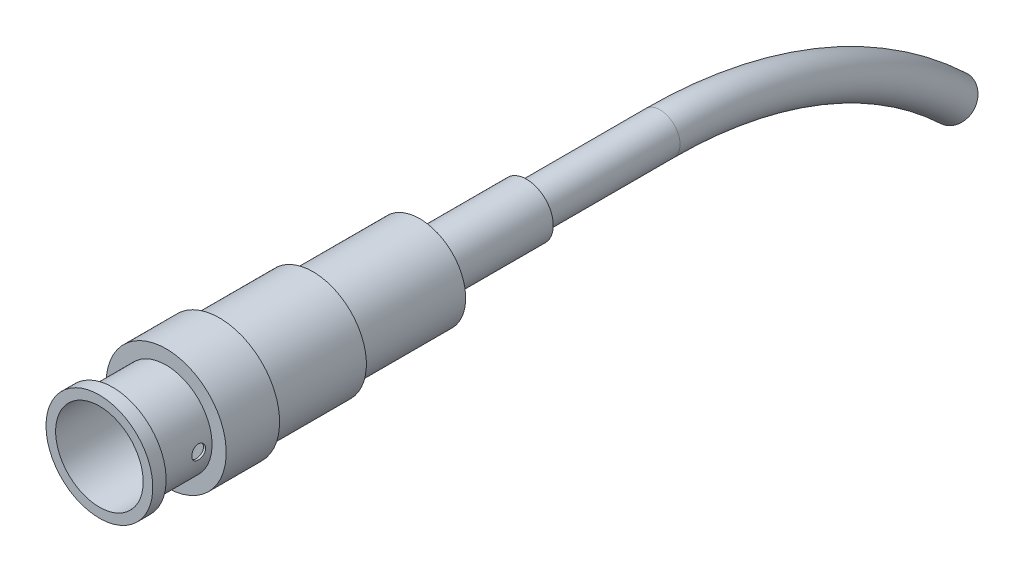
ISO-10303-21;
HEADER;
FILE_DESCRIPTION(('STEP AP214'),'2;1');
FILE_NAME('part.step','',(''),(''),'','','');
FILE_SCHEMA(('AUTOMOTIVE_DESIGN { 1 0 10303 214 1 1 1 1 }'));
ENDSEC;
DATA;
#1=APPLICATION_CONTEXT('core data for automotive mechanical design processes');
#2=APPLICATION_PROTOCOL_DEFINITION('international standard','automotive_design',2000,#1);
#3=PRODUCT_CONTEXT('',#1,'mechanical');
#4=PRODUCT('Part','Part','',(#3));
#5=PRODUCT_RELATED_PRODUCT_CATEGORY('part','',(#4));
#6=PRODUCT_DEFINITION_FORMATION('','',#4);
#7=PRODUCT_DEFINITION_CONTEXT('part definition',#1,'design');
#8=PRODUCT_DEFINITION('design','',#6,#7);
#9=PRODUCT_DEFINITION_SHAPE('','',#8);
#10=(LENGTH_UNIT() NAMED_UNIT(*) SI_UNIT(.MILLI.,.METRE.));
#11=(NAMED_UNIT(*) PLANE_ANGLE_UNIT() SI_UNIT($,.RADIAN.));
#12=(NAMED_UNIT(*) SI_UNIT($,.STERADIAN.) SOLID_ANGLE_UNIT());
#13=UNCERTAINTY_MEASURE_WITH_UNIT(LENGTH_MEASURE(1.E-05),#10,'distance_accuracy_value','');
#14=(GEOMETRIC_REPRESENTATION_CONTEXT(3) GLOBAL_UNCERTAINTY_ASSIGNED_CONTEXT((#13)) GLOBAL_UNIT_ASSIGNED_CONTEXT((#10,
#11,#12)) REPRESENTATION_CONTEXT('',''));
#15=CARTESIAN_POINT('',(0.,0.,0.));
#16=DIRECTION('',(0.,0.,1.));
#17=DIRECTION('',(1.,0.,0.));
#18=AXIS2_PLACEMENT_3D('',#15,#16,#17);
#19=CARTESIAN_POINT('',(0.,0.,0.));
#20=DIRECTION('',(0.,0.,-1.));
#21=DIRECTION('',(-1.,0.,0.));
#22=AXIS2_PLACEMENT_3D('',#19,#20,#21);
#23=CYLINDRICAL_SURFACE('',#22,5.461);
#24=CARTESIAN_POINT('',(5.461,0.,-5.5245));
#25=CARTESIAN_POINT('',(5.46099925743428,0.0460869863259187,-5.52450189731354));
#26=CARTESIAN_POINT('',(5.46041047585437,0.092200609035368,-5.52837252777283));
#27=CARTESIAN_POINT('',(5.45811837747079,0.1831386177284,-5.543748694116));
#28=CARTESIAN_POINT('',(5.45641397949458,0.227961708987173,-5.55526163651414));
#29=CARTESIAN_POINT('',(5.45208215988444,0.31498946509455,-5.58557030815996));
#30=CARTESIAN_POINT('',(5.44945543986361,0.357196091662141,-5.60436050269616));
#31=CARTESIAN_POINT('',(5.44356913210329,0.437850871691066,-5.64867670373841));
#32=CARTESIAN_POINT('',(5.44030963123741,0.476299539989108,-5.67420178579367));
#33=CARTESIAN_POINT('',(5.43349125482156,0.548658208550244,-5.73147881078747));
#34=CARTESIAN_POINT('',(5.42993042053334,0.582534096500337,-5.76327361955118));
#35=CARTESIAN_POINT('',(5.4229260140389,0.644491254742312,-5.83209531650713));
#36=CARTESIAN_POINT('',(5.41948244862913,0.672572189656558,-5.86912250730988));
#37=CARTESIAN_POINT('',(5.41308346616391,0.722275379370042,-5.94758744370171));
#38=CARTESIAN_POINT('',(5.41013058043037,0.743864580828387,-5.98904635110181));
#39=CARTESIAN_POINT('',(5.4050740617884,0.779760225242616,-6.07505393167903));
#40=CARTESIAN_POINT('',(5.40297038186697,0.794067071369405,-6.11960243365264));
#41=CARTESIAN_POINT('',(5.39986973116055,0.814885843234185,-6.21016568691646));
#42=CARTESIAN_POINT('',(5.39886446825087,0.821456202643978,-6.25616671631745));
#43=CARTESIAN_POINT('',(5.39804930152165,0.826796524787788,-6.34862852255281));
#44=CARTESIAN_POINT('',(5.39823932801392,0.825566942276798,-6.3950892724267));
#45=CARTESIAN_POINT('',(5.39978568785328,0.81539002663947,-6.48673859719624));
#46=CARTESIAN_POINT('',(5.40113218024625,0.80650781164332,-6.53193459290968));
#47=CARTESIAN_POINT('',(5.4048243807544,0.781379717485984,-6.62018728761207));
#48=CARTESIAN_POINT('',(5.40717011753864,0.765133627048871,-6.66324392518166));
#49=CARTESIAN_POINT('',(5.41260735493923,0.72567133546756,-6.74619359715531));
#50=CARTESIAN_POINT('',(5.4157017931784,0.702427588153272,-6.78607332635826));
#51=CARTESIAN_POINT('',(5.42228564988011,0.64964940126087,-6.86139108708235));
#52=CARTESIAN_POINT('',(5.42577509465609,0.620114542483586,-6.89682882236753));
#53=CARTESIAN_POINT('',(5.4327992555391,0.55523525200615,-6.96263401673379));
#54=CARTESIAN_POINT('',(5.43633407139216,0.519834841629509,-6.99294630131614));
#55=CARTESIAN_POINT('',(5.44301777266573,0.444420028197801,-7.04720799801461));
#56=CARTESIAN_POINT('',(5.44616665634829,0.404405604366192,-7.07115738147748));
#57=CARTESIAN_POINT('',(5.45172706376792,0.320850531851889,-7.11201642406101));
#58=CARTESIAN_POINT('',(5.45413813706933,0.277307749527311,-7.12892178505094));
#59=CARTESIAN_POINT('',(5.45794750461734,0.187956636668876,-7.15516471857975));
#60=CARTESIAN_POINT('',(5.45934586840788,0.142148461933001,-7.16450281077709));
#61=CARTESIAN_POINT('',(5.46096303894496,0.0500430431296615,-7.17527267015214));
#62=CARTESIAN_POINT('',(5.46119316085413,0.00375485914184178,-7.1767802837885));
#63=CARTESIAN_POINT('',(5.46047873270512,-0.0884132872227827,-7.17204776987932));
#64=CARTESIAN_POINT('',(5.45953421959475,-0.134293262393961,-7.16580788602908));
#65=CARTESIAN_POINT('',(5.45658364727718,-0.224112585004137,-7.14582057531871));
#66=CARTESIAN_POINT('',(5.45458282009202,-0.268060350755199,-7.13211014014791));
#67=CARTESIAN_POINT('',(5.44974322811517,-0.353033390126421,-7.09760995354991));
#68=CARTESIAN_POINT('',(5.44690442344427,-0.394058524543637,-7.07681986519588));
#69=CARTESIAN_POINT('',(5.44067619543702,-0.472354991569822,-7.02857286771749));
#70=CARTESIAN_POINT('',(5.4372828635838,-0.509596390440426,-7.00106789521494));
#71=CARTESIAN_POINT('',(5.43033533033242,-0.578961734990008,-6.94023875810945));
#72=CARTESIAN_POINT('',(5.42678111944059,-0.611085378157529,-6.90691424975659));
#73=CARTESIAN_POINT('',(5.41987648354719,-0.669579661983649,-6.83505417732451));
#74=CARTESIAN_POINT('',(5.41652803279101,-0.695899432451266,-6.79647698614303));
#75=CARTESIAN_POINT('',(5.41044913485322,-0.741685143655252,-6.71540452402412));
#76=CARTESIAN_POINT('',(5.40771867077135,-0.761151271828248,-6.67290936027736));
#77=CARTESIAN_POINT('',(5.4031992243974,-0.792598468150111,-6.58535829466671));
#78=CARTESIAN_POINT('',(5.40140689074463,-0.804606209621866,-6.54031215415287));
#79=CARTESIAN_POINT('',(5.39895776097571,-0.820880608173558,-6.44881343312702));
#80=CARTESIAN_POINT('',(5.39830088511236,-0.825147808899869,-6.40236095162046));
#81=CARTESIAN_POINT('',(5.39820005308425,-0.825806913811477,-6.30987526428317));
#82=CARTESIAN_POINT('',(5.39874377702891,-0.822278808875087,-6.26384262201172));
#83=CARTESIAN_POINT('',(5.40095609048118,-0.807618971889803,-6.17303340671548));
#84=CARTESIAN_POINT('',(5.40262467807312,-0.796487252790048,-6.12825683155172));
#85=CARTESIAN_POINT('',(5.40689437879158,-0.766964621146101,-6.04125354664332));
#86=CARTESIAN_POINT('',(5.40949476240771,-0.748579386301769,-5.9990248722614));
#87=CARTESIAN_POINT('',(5.4153359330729,-0.705079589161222,-5.91823852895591));
#88=CARTESIAN_POINT('',(5.41857674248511,-0.679964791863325,-5.87968098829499));
#89=CARTESIAN_POINT('',(5.42537318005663,-0.623428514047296,-5.80692516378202));
#90=CARTESIAN_POINT('',(5.42893157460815,-0.59194781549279,-5.77277314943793));
#91=CARTESIAN_POINT('',(5.43593921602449,-0.52369850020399,-5.71020824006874));
#92=CARTESIAN_POINT('',(5.43938843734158,-0.486928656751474,-5.68179668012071));
#93=CARTESIAN_POINT('',(5.44581116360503,-0.408902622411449,-5.63137694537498));
#94=CARTESIAN_POINT('',(5.44878189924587,-0.367622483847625,-5.60940548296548));
#95=CARTESIAN_POINT('',(5.45388579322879,-0.281932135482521,-5.57274083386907));
#96=CARTESIAN_POINT('',(5.45601981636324,-0.237525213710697,-5.55804012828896));
#97=CARTESIAN_POINT('',(5.45872414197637,-0.16076738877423,-5.5396597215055));
#98=CARTESIAN_POINT('',(5.45957319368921,-0.128889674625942,-5.53398354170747));
#99=CARTESIAN_POINT('',(5.46071137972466,-0.0646790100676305,-5.52640303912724));
#100=CARTESIAN_POINT('',(5.46100052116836,-0.0323460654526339,-5.52449866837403));
#101=CARTESIAN_POINT('',(5.461,0.,-5.5245));
#102=B_SPLINE_CURVE_WITH_KNOTS('',3,(#24,#25,#26,#27,#28,#29,#30,#31,#32,#33,#34,#35,#36,#37,
#38,#39,#40,#41,#42,#43,#44,#45,#46,#47,#48,#49,#50,#51,#52,#53,#54,#55,#56,#57,#58,#59,#60,#61,
#62,#63,#64,#65,#66,#67,#68,#69,#70,#71,#72,#73,#74,#75,#76,#77,#78,#79,#80,#81,#82,#83,#84,#85,
#86,#87,#88,#89,#90,#91,#92,#93,#94,#95,#96,#97,#98,#99,#100,#101),.UNSPECIFIED.,.T.,.F.,(4,2,2,
2,2,2,2,2,2,2,2,2,2,2,2,2,2,2,2,2,2,2,2,2,2,2,2,2,2,2,2,2,2,2,2,2,2,2,4),(0.,0.138142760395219,
0.276419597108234,0.414591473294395,0.552744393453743,0.691876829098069,0.831017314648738,
0.970854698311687,1.11068433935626,1.24945093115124,1.3882094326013,1.52579873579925,
1.66339198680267,1.80153411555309,1.93968545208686,2.07924046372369,2.21879610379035,
2.3584367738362,2.49806785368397,2.63634390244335,2.77461560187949,2.91220876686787,
3.04980848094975,3.18842356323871,3.32704683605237,3.4668406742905,3.60663068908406,
3.74591785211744,3.88519523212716,4.0230500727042,4.16090467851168,4.29865159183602,
4.43640331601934,4.57550085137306,4.71463069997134,4.85453889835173,4.99430210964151,
5.09125858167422,5.18821382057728),.UNSPECIFIED.);
#103=CARTESIAN_POINT('',(5.461,0.,-5.5245));
#104=VERTEX_POINT('',#103);
#105=EDGE_CURVE('E72',#104,#104,#102,.T.);
#106=ORIENTED_EDGE('',*,*,#105,.T.);
#107=EDGE_LOOP('',(#106));
#108=FACE_BOUND('',#107,.T.);
#109=CARTESIAN_POINT('',(0.,0.,-1.5875));
#110=DIRECTION('',(0.,0.,-1.));
#111=DIRECTION('',(-1.,0.,0.));
#112=AXIS2_PLACEMENT_3D('',#109,#110,#111);
#113=CIRCLE('',#112,5.461);
#114=CARTESIAN_POINT('',(-5.461,0.,-1.5875));
#115=VERTEX_POINT('',#114);
#116=EDGE_CURVE('E161',#115,#115,#113,.T.);
#117=ORIENTED_EDGE('',*,*,#116,.T.);
#118=EDGE_LOOP('',(#117));
#119=FACE_BOUND('',#118,.T.);
#120=CARTESIAN_POINT('',(0.,0.,-7.9375));
#121=DIRECTION('',(0.,0.,-1.));
#122=DIRECTION('',(-1.,0.,0.));
#123=AXIS2_PLACEMENT_3D('',#120,#121,#122);
#124=CIRCLE('',#123,5.461);
#125=CARTESIAN_POINT('',(-5.461,0.,-7.9375));
#126=VERTEX_POINT('',#125);
#127=EDGE_CURVE('E164',#126,#126,#124,.T.);
#128=ORIENTED_EDGE('',*,*,#127,.F.);
#129=EDGE_LOOP('',(#128));
#130=FACE_BOUND('',#129,.T.);
#131=CARTESIAN_POINT('',(-5.461,0.,-5.5245));
#132=CARTESIAN_POINT('',(-5.46099925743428,-0.0460869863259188,-5.52450189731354));
#133=CARTESIAN_POINT('',(-5.46041047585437,-0.0922006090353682,-5.52837252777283));
#134=CARTESIAN_POINT('',(-5.45811837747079,-0.1831386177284,-5.543748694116));
#135=CARTESIAN_POINT('',(-5.45641397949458,-0.227961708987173,-5.55526163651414));
#136=CARTESIAN_POINT('',(-5.45208215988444,-0.31498946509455,-5.58557030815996));
#137=CARTESIAN_POINT('',(-5.44945543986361,-0.357196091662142,-5.60436050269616));
#138=CARTESIAN_POINT('',(-5.44356913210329,-0.437850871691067,-5.64867670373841));
#139=CARTESIAN_POINT('',(-5.44030963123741,-0.476299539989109,-5.67420178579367));
#140=CARTESIAN_POINT('',(-5.43349125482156,-0.548658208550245,-5.73147881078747));
#141=CARTESIAN_POINT('',(-5.42993042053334,-0.582534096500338,-5.76327361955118));
#142=CARTESIAN_POINT('',(-5.4229260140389,-0.644491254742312,-5.83209531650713));
#143=CARTESIAN_POINT('',(-5.41948244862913,-0.672572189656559,-5.86912250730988));
#144=CARTESIAN_POINT('',(-5.41308346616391,-0.722275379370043,-5.94758744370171));
#145=CARTESIAN_POINT('',(-5.41013058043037,-0.743864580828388,-5.98904635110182));
#146=CARTESIAN_POINT('',(-5.4050740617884,-0.779760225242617,-6.07505393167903));
#147=CARTESIAN_POINT('',(-5.40297038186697,-0.794067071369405,-6.11960243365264));
#148=CARTESIAN_POINT('',(-5.39986973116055,-0.814885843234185,-6.21016568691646));
#149=CARTESIAN_POINT('',(-5.39886446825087,-0.821456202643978,-6.25616671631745));
#150=CARTESIAN_POINT('',(-5.39804930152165,-0.826796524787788,-6.34862852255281));
#151=CARTESIAN_POINT('',(-5.39823932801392,-0.825566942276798,-6.3950892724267));
#152=CARTESIAN_POINT('',(-5.39978568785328,-0.81539002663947,-6.48673859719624));
#153=CARTESIAN_POINT('',(-5.40113218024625,-0.80650781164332,-6.53193459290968));
#154=CARTESIAN_POINT('',(-5.4048243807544,-0.781379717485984,-6.62018728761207));
#155=CARTESIAN_POINT('',(-5.40717011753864,-0.765133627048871,-6.66324392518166));
#156=CARTESIAN_POINT('',(-5.41260735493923,-0.72567133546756,-6.74619359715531));
#157=CARTESIAN_POINT('',(-5.4157017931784,-0.702427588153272,-6.78607332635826));
#158=CARTESIAN_POINT('',(-5.42228564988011,-0.64964940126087,-6.86139108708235));
#159=CARTESIAN_POINT('',(-5.42577509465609,-0.620114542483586,-6.89682882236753));
#160=CARTESIAN_POINT('',(-5.4327992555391,-0.55523525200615,-6.9626340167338));
#161=CARTESIAN_POINT('',(-5.43633407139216,-0.519834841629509,-6.99294630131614));
#162=CARTESIAN_POINT('',(-5.44301777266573,-0.4444200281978,-7.04720799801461));
#163=CARTESIAN_POINT('',(-5.44616665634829,-0.404405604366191,-7.07115738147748));
#164=CARTESIAN_POINT('',(-5.45172706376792,-0.320850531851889,-7.11201642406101));
#165=CARTESIAN_POINT('',(-5.45413813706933,-0.277307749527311,-7.12892178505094));
#166=CARTESIAN_POINT('',(-5.45794750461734,-0.187956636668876,-7.15516471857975));
#167=CARTESIAN_POINT('',(-5.45934586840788,-0.142148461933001,-7.16450281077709));
#168=CARTESIAN_POINT('',(-5.46096303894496,-0.0500430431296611,-7.17527267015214));
#169=CARTESIAN_POINT('',(-5.46119316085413,-0.00375485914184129,-7.1767802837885));
#170=CARTESIAN_POINT('',(-5.46047873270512,0.0884132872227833,-7.17204776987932));
#171=CARTESIAN_POINT('',(-5.45953421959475,0.134293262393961,-7.16580788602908));
#172=CARTESIAN_POINT('',(-5.45658364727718,0.224112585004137,-7.14582057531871));
#173=CARTESIAN_POINT('',(-5.45458282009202,0.2680603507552,-7.13211014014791));
#174=CARTESIAN_POINT('',(-5.44974322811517,0.353033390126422,-7.09760995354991));
#175=CARTESIAN_POINT('',(-5.44690442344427,0.394058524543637,-7.07681986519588));
#176=CARTESIAN_POINT('',(-5.44067619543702,0.472354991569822,-7.02857286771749));
#177=CARTESIAN_POINT('',(-5.4372828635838,0.509596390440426,-7.00106789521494));
#178=CARTESIAN_POINT('',(-5.43033533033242,0.578961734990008,-6.94023875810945));
#179=CARTESIAN_POINT('',(-5.42678111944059,0.61108537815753,-6.90691424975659));
#180=CARTESIAN_POINT('',(-5.41987648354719,0.66957966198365,-6.83505417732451));
#181=CARTESIAN_POINT('',(-5.41652803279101,0.695899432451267,-6.79647698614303));
#182=CARTESIAN_POINT('',(-5.41044913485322,0.741685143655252,-6.71540452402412));
#183=CARTESIAN_POINT('',(-5.40771867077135,0.761151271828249,-6.67290936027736));
#184=CARTESIAN_POINT('',(-5.4031992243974,0.792598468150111,-6.58535829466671));
#185=CARTESIAN_POINT('',(-5.40140689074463,0.804606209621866,-6.54031215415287));
#186=CARTESIAN_POINT('',(-5.39895776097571,0.820880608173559,-6.44881343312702));
#187=CARTESIAN_POINT('',(-5.39830088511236,0.825147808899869,-6.40236095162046));
#188=CARTESIAN_POINT('',(-5.39820005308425,0.825806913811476,-6.30987526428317));
#189=CARTESIAN_POINT('',(-5.39874377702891,0.822278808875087,-6.26384262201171));
#190=CARTESIAN_POINT('',(-5.40095609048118,0.807618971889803,-6.17303340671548));
#191=CARTESIAN_POINT('',(-5.40262467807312,0.796487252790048,-6.12825683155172));
#192=CARTESIAN_POINT('',(-5.40689437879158,0.766964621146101,-6.04125354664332));
#193=CARTESIAN_POINT('',(-5.40949476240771,0.748579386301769,-5.9990248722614));
#194=CARTESIAN_POINT('',(-5.4153359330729,0.705079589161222,-5.91823852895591));
#195=CARTESIAN_POINT('',(-5.41857674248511,0.679964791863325,-5.87968098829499));
#196=CARTESIAN_POINT('',(-5.42537318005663,0.623428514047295,-5.80692516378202));
#197=CARTESIAN_POINT('',(-5.42893157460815,0.591947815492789,-5.77277314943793));
#198=CARTESIAN_POINT('',(-5.43593921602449,0.523698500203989,-5.71020824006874));
#199=CARTESIAN_POINT('',(-5.43938843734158,0.486928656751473,-5.68179668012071));
#200=CARTESIAN_POINT('',(-5.44581116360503,0.408902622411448,-5.63137694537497));
#201=CARTESIAN_POINT('',(-5.44878189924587,0.367622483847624,-5.60940548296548));
#202=CARTESIAN_POINT('',(-5.45388579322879,0.28193213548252,-5.57274083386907));
#203=CARTESIAN_POINT('',(-5.45601981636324,0.237525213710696,-5.55804012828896));
#204=CARTESIAN_POINT('',(-5.45872414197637,0.160767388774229,-5.5396597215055));
#205=CARTESIAN_POINT('',(-5.45957319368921,0.128889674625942,-5.53398354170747));
#206=CARTESIAN_POINT('',(-5.46071137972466,0.0646790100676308,-5.52640303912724));
#207=CARTESIAN_POINT('',(-5.46100052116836,0.032346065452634,-5.52449866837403));
#208=CARTESIAN_POINT('',(-5.461,0.,-5.5245));
#209=B_SPLINE_CURVE_WITH_KNOTS('',3,(#131,#132,#133,#134,#135,#136,#137,#138,#139,#140,#141,
#142,#143,#144,#145,#146,#147,#148,#149,#150,#151,#152,#153,#154,#155,#156,#157,#158,#159,#160,
#161,#162,#163,#164,#165,#166,#167,#168,#169,#170,#171,#172,#173,#174,#175,#176,#177,#178,#179,
#180,#181,#182,#183,#184,#185,#186,#187,#188,#189,#190,#191,#192,#193,#194,#195,#196,#197,#198,
#199,#200,#201,#202,#203,#204,#205,#206,#207,#208),.UNSPECIFIED.,.T.,.F.,(4,2,2,2,2,2,2,2,2,2,2,
2,2,2,2,2,2,2,2,2,2,2,2,2,2,2,2,2,2,2,2,2,2,2,2,2,2,2,4),(0.,0.138142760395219,
0.276419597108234,0.414591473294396,0.552744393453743,0.69187682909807,0.831017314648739,
0.970854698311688,1.11068433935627,1.24945093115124,1.3882094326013,1.52579873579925,
1.66339198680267,1.80153411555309,1.93968545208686,2.07924046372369,2.21879610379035,
2.3584367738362,2.49806785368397,2.63634390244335,2.77461560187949,2.91220876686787,
3.04980848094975,3.18842356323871,3.32704683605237,3.4668406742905,3.60663068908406,
3.74591785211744,3.88519523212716,4.0230500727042,4.16090467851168,4.29865159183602,
4.43640331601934,4.57550085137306,4.71463069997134,4.85453889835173,4.99430210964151,
5.09125858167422,5.18821382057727),.UNSPECIFIED.);
#210=CARTESIAN_POINT('',(-5.461,0.,-5.5245));
#211=VERTEX_POINT('',#210);
#212=EDGE_CURVE('E79',#211,#211,#209,.T.);
#213=ORIENTED_EDGE('',*,*,#212,.T.);
#214=EDGE_LOOP('',(#213));
#215=FACE_BOUND('',#214,.T.);
#216=ADVANCED_FACE('F40',(#108,#119,#130,#215),#23,.T.);
#217=CARTESIAN_POINT('',(0.,0.,-10.31875));
#218=DIRECTION('',(0.,0.,1.));
#219=DIRECTION('',(1.,0.,0.));
#220=AXIS2_PLACEMENT_3D('',#217,#218,#219);
#221=CYLINDRICAL_SURFACE('',#220,5.207);
#222=CARTESIAN_POINT('',(-5.207,0.,-5.5245));
#223=CARTESIAN_POINT('',(-5.20699923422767,-0.0460591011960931,-5.52450187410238));
#224=CARTESIAN_POINT('',(-5.20638248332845,-0.0921441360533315,-5.52836784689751));
#225=CARTESIAN_POINT('',(-5.20398151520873,-0.183023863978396,-5.54372442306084));
#226=CARTESIAN_POINT('',(-5.20219619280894,-0.227817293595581,-5.55522224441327));
#227=CARTESIAN_POINT('',(-5.19765852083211,-0.314785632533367,-5.58548847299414));
#228=CARTESIAN_POINT('',(-5.19490693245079,-0.356962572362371,-5.60425115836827));
#229=CARTESIAN_POINT('',(-5.18874002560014,-0.437563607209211,-5.64850002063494));
#230=CARTESIAN_POINT('',(-5.18532479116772,-0.475988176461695,-5.67398534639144));
#231=CARTESIAN_POINT('',(-5.17817661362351,-0.54833342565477,-5.73119173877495));
#232=CARTESIAN_POINT('',(-5.17444140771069,-0.582216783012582,-5.7629597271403));
#233=CARTESIAN_POINT('',(-5.16709178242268,-0.644195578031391,-5.83172867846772));
#234=CARTESIAN_POINT('',(-5.16347737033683,-0.672290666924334,-5.86872995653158));
#235=CARTESIAN_POINT('',(-5.15675664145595,-0.722042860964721,-5.94716876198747));
#236=CARTESIAN_POINT('',(-5.1536532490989,-0.74366345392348,-5.98862972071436));
#237=CARTESIAN_POINT('',(-5.14833709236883,-0.779619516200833,-6.07465213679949));
#238=CARTESIAN_POINT('',(-5.14612427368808,-0.793955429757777,-6.11921340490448));
#239=CARTESIAN_POINT('',(-5.14286220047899,-0.814818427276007,-6.20977739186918));
#240=CARTESIAN_POINT('',(-5.14180338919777,-0.821409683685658,-6.25576497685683));
#241=CARTESIAN_POINT('',(-5.14094025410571,-0.826795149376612,-6.34820467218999));
#242=CARTESIAN_POINT('',(-5.14113584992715,-0.825589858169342,-6.39465675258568));
#243=CARTESIAN_POINT('',(-5.14275069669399,-0.815468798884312,-6.48625113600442));
#244=CARTESIAN_POINT('',(-5.14415855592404,-0.806624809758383,-6.5314016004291));
#245=CARTESIAN_POINT('',(-5.14802148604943,-0.781589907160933,-6.61956958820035));
#246=CARTESIAN_POINT('',(-5.15047658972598,-0.765398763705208,-6.66258704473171));
#247=CARTESIAN_POINT('',(-5.15616982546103,-0.726055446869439,-6.74548454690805));
#248=CARTESIAN_POINT('',(-5.15941133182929,-0.702873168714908,-6.78535006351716));
#249=CARTESIAN_POINT('',(-5.16630974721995,-0.650227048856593,-6.86065247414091));
#250=CARTESIAN_POINT('',(-5.16996668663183,-0.620762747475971,-6.8960890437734));
#251=CARTESIAN_POINT('',(-5.17733411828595,-0.555996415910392,-6.96194339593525));
#252=CARTESIAN_POINT('',(-5.18104475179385,-0.520632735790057,-6.99230056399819));
#253=CARTESIAN_POINT('',(-5.18806355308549,-0.445280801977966,-7.04665874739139));
#254=CARTESIAN_POINT('',(-5.19137171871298,-0.405292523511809,-7.0706597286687));
#255=CARTESIAN_POINT('',(-5.19721690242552,-0.321771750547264,-7.11162855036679));
#256=CARTESIAN_POINT('',(-5.19975337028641,-0.278236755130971,-7.12859137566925));
#257=CARTESIAN_POINT('',(-5.20376486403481,-0.188886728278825,-7.15494790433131));
#258=CARTESIAN_POINT('',(-5.20523997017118,-0.143071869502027,-7.16434217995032));
#259=CARTESIAN_POINT('',(-5.20695182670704,-0.0509854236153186,-7.17521355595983));
#260=CARTESIAN_POINT('',(-5.20720160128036,-0.00472390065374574,-7.17677392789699));
#261=CARTESIAN_POINT('',(-5.20647021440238,0.0873998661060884,-7.17215471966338));
#262=CARTESIAN_POINT('',(-5.20548909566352,0.133262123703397,-7.16597540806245));
#263=CARTESIAN_POINT('',(-5.20241421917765,0.223030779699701,-7.14612149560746));
#264=CARTESIAN_POINT('',(-5.20032653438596,0.266946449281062,-7.13248779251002));
#265=CARTESIAN_POINT('',(-5.19527175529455,0.351868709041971,-7.09815547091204));
#266=CARTESIAN_POINT('',(-5.19230461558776,0.392875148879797,-7.07745648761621));
#267=CARTESIAN_POINT('',(-5.18578802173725,0.471178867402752,-7.02938813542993));
#268=CARTESIAN_POINT('',(-5.18223406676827,0.508443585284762,-7.00196634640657));
#269=CARTESIAN_POINT('',(-5.17495254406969,0.577871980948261,-6.94130333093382));
#270=CARTESIAN_POINT('',(-5.17122496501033,0.610035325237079,-6.90806172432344));
#271=CARTESIAN_POINT('',(-5.16397460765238,0.668653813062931,-6.83633057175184));
#272=CARTESIAN_POINT('',(-5.16045406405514,0.695052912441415,-6.79779496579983));
#273=CARTESIAN_POINT('',(-5.15405703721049,0.741003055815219,-6.71678729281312));
#274=CARTESIAN_POINT('',(-5.1511805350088,0.760554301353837,-6.67431534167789));
#275=CARTESIAN_POINT('',(-5.14641375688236,0.79216840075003,-6.58680251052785));
#276=CARTESIAN_POINT('',(-5.14451970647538,0.804259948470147,-6.54177221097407));
#277=CARTESIAN_POINT('',(-5.14192252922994,0.820702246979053,-6.45028748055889));
#278=CARTESIAN_POINT('',(-5.14121930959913,0.825053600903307,-6.40383316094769));
#279=CARTESIAN_POINT('',(-5.14108714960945,0.825876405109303,-6.31137816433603));
#280=CARTESIAN_POINT('',(-5.14164395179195,0.822436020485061,-6.26537826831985));
#281=CARTESIAN_POINT('',(-5.14393798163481,0.807962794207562,-6.17462037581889));
#282=CARTESIAN_POINT('',(-5.1456752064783,0.796929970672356,-6.12986237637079));
#283=CARTESIAN_POINT('',(-5.1501291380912,0.767617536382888,-6.04288806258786));
#284=CARTESIAN_POINT('',(-5.15284491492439,0.749344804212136,-6.00066937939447));
#285=CARTESIAN_POINT('',(-5.15895096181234,0.706080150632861,-5.91988261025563));
#286=CARTESIAN_POINT('',(-5.16234126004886,0.68108794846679,-5.88131467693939));
#287=CARTESIAN_POINT('',(-5.16945987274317,0.624776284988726,-5.80847749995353));
#288=CARTESIAN_POINT('',(-5.173191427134,0.593391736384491,-5.77425888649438));
#289=CARTESIAN_POINT('',(-5.18054565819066,0.525323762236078,-5.71154317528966));
#290=CARTESIAN_POINT('',(-5.18416830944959,0.488639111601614,-5.68304740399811));
#291=CARTESIAN_POINT('',(-5.19092238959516,0.410743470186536,-5.63242666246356));
#292=CARTESIAN_POINT('',(-5.19405063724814,0.369505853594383,-5.6103422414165));
#293=CARTESIAN_POINT('',(-5.19943239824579,0.283874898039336,-5.57344715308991));
#294=CARTESIAN_POINT('',(-5.20168679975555,0.239484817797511,-5.55862909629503));
#295=CARTESIAN_POINT('',(-5.20456352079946,0.162423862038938,-5.53997668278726));
#296=CARTESIAN_POINT('',(-5.20547241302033,0.130224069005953,-5.53418200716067));
#297=CARTESIAN_POINT('',(-5.20669091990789,0.0653538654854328,-5.52644302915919));
#298=CARTESIAN_POINT('',(-5.20700054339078,0.0326834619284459,-5.52449867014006));
#299=CARTESIAN_POINT('',(-5.207,0.,-5.5245));
#300=B_SPLINE_CURVE_WITH_KNOTS('',3,(#222,#223,#224,#225,#226,#227,#228,#229,#230,#231,#232,
#233,#234,#235,#236,#237,#238,#239,#240,#241,#242,#243,#244,#245,#246,#247,#248,#249,#250,#251,
#252,#253,#254,#255,#256,#257,#258,#259,#260,#261,#262,#263,#264,#265,#266,#267,#268,#269,#270,
#271,#272,#273,#274,#275,#276,#277,#278,#279,#280,#281,#282,#283,#284,#285,#286,#287,#288,#289,
#290,#291,#292,#293,#294,#295,#296,#297,#298,#299),.UNSPECIFIED.,.T.,.F.,(4,2,2,2,2,2,2,2,2,2,2,
2,2,2,2,2,2,2,2,2,2,2,2,2,2,2,2,2,2,2,2,2,2,2,2,2,2,2,4),(0.,0.138057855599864,
0.276246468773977,0.414326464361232,0.55238898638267,0.691524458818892,0.830668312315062,
0.970582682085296,1.11048851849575,1.24922672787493,1.38795604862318,1.52539577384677,
1.66283980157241,1.80088434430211,1.93893899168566,2.07853887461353,2.21813950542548,
2.35783944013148,2.49752881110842,2.63573014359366,2.77392668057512,2.91137251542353,
3.04882544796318,3.18738628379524,3.32595617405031,3.46581863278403,3.60567697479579,
3.74499393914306,3.88430004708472,4.02203776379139,4.15977515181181,4.29738198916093,
4.43499457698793,4.57408548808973,4.7132086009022,4.85319334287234,4.99303543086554,
5.0910024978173,5.18896812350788),.UNSPECIFIED.);
#301=CARTESIAN_POINT('',(-5.207,0.,-5.5245));
#302=VERTEX_POINT('',#301);
#303=EDGE_CURVE('E71',#302,#302,#300,.T.);
#304=ORIENTED_EDGE('',*,*,#303,.F.);
#305=EDGE_LOOP('',(#304));
#306=FACE_BOUND('',#305,.T.);
#307=CARTESIAN_POINT('',(0.,0.,-10.31875));
#308=DIRECTION('',(0.,0.,1.));
#309=DIRECTION('',(1.,0.,0.));
#310=AXIS2_PLACEMENT_3D('',#307,#308,#309);
#311=CIRCLE('',#310,5.207);
#312=CARTESIAN_POINT('',(5.207,0.,-10.31875));
#313=VERTEX_POINT('',#312);
#314=EDGE_CURVE('E173',#313,#313,#311,.T.);
#315=ORIENTED_EDGE('',*,*,#314,.F.);
#316=EDGE_LOOP('',(#315));
#317=FACE_BOUND('',#316,.T.);
#318=CARTESIAN_POINT('',(0.,0.,0.));
#319=DIRECTION('',(0.,0.,1.));
#320=DIRECTION('',(1.,0.,0.));
#321=AXIS2_PLACEMENT_3D('',#318,#319,#320);
#322=CIRCLE('',#321,5.207);
#323=CARTESIAN_POINT('',(5.207,0.,0.));
#324=VERTEX_POINT('',#323);
#325=EDGE_CURVE('E169',#324,#324,#322,.T.);
#326=ORIENTED_EDGE('',*,*,#325,.T.);
#327=EDGE_LOOP('',(#326));
#328=FACE_BOUND('',#327,.T.);
#329=CARTESIAN_POINT('',(5.207,0.,-7.1755));
#330=CARTESIAN_POINT('',(5.20699923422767,-0.0460591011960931,-7.17549812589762));
#331=CARTESIAN_POINT('',(5.20638248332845,-0.0921441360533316,-7.17163215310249));
#332=CARTESIAN_POINT('',(5.20398151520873,-0.183023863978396,-7.15627557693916));
#333=CARTESIAN_POINT('',(5.20219619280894,-0.227817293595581,-7.14477775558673));
#334=CARTESIAN_POINT('',(5.19765852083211,-0.314785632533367,-7.11451152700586));
#335=CARTESIAN_POINT('',(5.19490693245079,-0.356962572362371,-7.09574884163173));
#336=CARTESIAN_POINT('',(5.18874002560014,-0.437563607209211,-7.05149997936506));
#337=CARTESIAN_POINT('',(5.18532479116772,-0.475988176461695,-7.02601465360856));
#338=CARTESIAN_POINT('',(5.17817661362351,-0.54833342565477,-6.96880826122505));
#339=CARTESIAN_POINT('',(5.17444140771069,-0.582216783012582,-6.9370402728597));
#340=CARTESIAN_POINT('',(5.16709178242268,-0.644195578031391,-6.86827132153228));
#341=CARTESIAN_POINT('',(5.16347737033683,-0.672290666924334,-6.83127004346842));
#342=CARTESIAN_POINT('',(5.15675664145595,-0.722042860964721,-6.75283123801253));
#343=CARTESIAN_POINT('',(5.1536532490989,-0.74366345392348,-6.71137027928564));
#344=CARTESIAN_POINT('',(5.14833709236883,-0.779619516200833,-6.62534786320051));
#345=CARTESIAN_POINT('',(5.14612427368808,-0.793955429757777,-6.58078659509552));
#346=CARTESIAN_POINT('',(5.14286220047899,-0.814818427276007,-6.49022260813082));
#347=CARTESIAN_POINT('',(5.14180338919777,-0.821409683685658,-6.44423502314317));
#348=CARTESIAN_POINT('',(5.14094025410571,-0.826795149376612,-6.35179532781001));
#349=CARTESIAN_POINT('',(5.14113584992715,-0.825589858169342,-6.30534324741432));
#350=CARTESIAN_POINT('',(5.14275069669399,-0.815468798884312,-6.21374886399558));
#351=CARTESIAN_POINT('',(5.14415855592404,-0.806624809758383,-6.1685983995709));
#352=CARTESIAN_POINT('',(5.14802148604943,-0.781589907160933,-6.08043041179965));
#353=CARTESIAN_POINT('',(5.15047658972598,-0.765398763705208,-6.03741295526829));
#354=CARTESIAN_POINT('',(5.15616982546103,-0.726055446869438,-5.95451545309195));
#355=CARTESIAN_POINT('',(5.15941133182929,-0.702873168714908,-5.91464993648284));
#356=CARTESIAN_POINT('',(5.16630974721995,-0.650227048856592,-5.83934752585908));
#357=CARTESIAN_POINT('',(5.16996668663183,-0.620762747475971,-5.80391095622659));
#358=CARTESIAN_POINT('',(5.17733411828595,-0.555996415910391,-5.73805660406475));
#359=CARTESIAN_POINT('',(5.18104475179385,-0.520632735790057,-5.7076994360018));
#360=CARTESIAN_POINT('',(5.18806355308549,-0.445280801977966,-5.65334125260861));
#361=CARTESIAN_POINT('',(5.19137171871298,-0.405292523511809,-5.6293402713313));
#362=CARTESIAN_POINT('',(5.19721690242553,-0.321771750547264,-5.58837144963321));
#363=CARTESIAN_POINT('',(5.19975337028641,-0.27823675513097,-5.57140862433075));
#364=CARTESIAN_POINT('',(5.20376486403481,-0.188886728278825,-5.54505209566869));
#365=CARTESIAN_POINT('',(5.20523997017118,-0.143071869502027,-5.53565782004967));
#366=CARTESIAN_POINT('',(5.20695182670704,-0.0509854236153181,-5.52478644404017));
#367=CARTESIAN_POINT('',(5.20720160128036,-0.00472390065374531,-5.52322607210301));
#368=CARTESIAN_POINT('',(5.20647021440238,0.0873998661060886,-5.52784528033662));
#369=CARTESIAN_POINT('',(5.20548909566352,0.133262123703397,-5.53402459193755));
#370=CARTESIAN_POINT('',(5.20241421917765,0.223030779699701,-5.55387850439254));
#371=CARTESIAN_POINT('',(5.20032653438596,0.266946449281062,-5.56751220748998));
#372=CARTESIAN_POINT('',(5.19527175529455,0.351868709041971,-5.60184452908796));
#373=CARTESIAN_POINT('',(5.19230461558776,0.392875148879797,-5.62254351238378));
#374=CARTESIAN_POINT('',(5.18578802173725,0.471178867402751,-5.67061186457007));
#375=CARTESIAN_POINT('',(5.18223406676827,0.508443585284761,-5.69803365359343));
#376=CARTESIAN_POINT('',(5.17495254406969,0.577871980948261,-5.75869666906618));
#377=CARTESIAN_POINT('',(5.17122496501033,0.610035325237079,-5.79193827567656));
#378=CARTESIAN_POINT('',(5.16397460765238,0.668653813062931,-5.86366942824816));
#379=CARTESIAN_POINT('',(5.16045406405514,0.695052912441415,-5.90220503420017));
#380=CARTESIAN_POINT('',(5.15405703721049,0.741003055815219,-5.98321270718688));
#381=CARTESIAN_POINT('',(5.1511805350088,0.760554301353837,-6.02568465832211));
#382=CARTESIAN_POINT('',(5.14641375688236,0.79216840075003,-6.11319748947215));
#383=CARTESIAN_POINT('',(5.14451970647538,0.804259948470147,-6.15822778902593));
#384=CARTESIAN_POINT('',(5.14192252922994,0.820702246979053,-6.24971251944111));
#385=CARTESIAN_POINT('',(5.14121930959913,0.825053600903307,-6.29616683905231));
#386=CARTESIAN_POINT('',(5.14108714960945,0.825876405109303,-6.38862183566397));
#387=CARTESIAN_POINT('',(5.14164395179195,0.822436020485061,-6.43462173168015));
#388=CARTESIAN_POINT('',(5.14393798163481,0.807962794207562,-6.52537962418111));
#389=CARTESIAN_POINT('',(5.1456752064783,0.796929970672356,-6.57013762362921));
#390=CARTESIAN_POINT('',(5.1501291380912,0.767617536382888,-6.65711193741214));
#391=CARTESIAN_POINT('',(5.15284491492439,0.749344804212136,-6.69933062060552));
#392=CARTESIAN_POINT('',(5.15895096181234,0.706080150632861,-6.78011738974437));
#393=CARTESIAN_POINT('',(5.16234126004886,0.68108794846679,-6.81868532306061));
#394=CARTESIAN_POINT('',(5.16945987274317,0.624776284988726,-6.89152250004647));
#395=CARTESIAN_POINT('',(5.173191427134,0.593391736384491,-6.92574111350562));
#396=CARTESIAN_POINT('',(5.18054565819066,0.525323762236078,-6.98845682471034));
#397=CARTESIAN_POINT('',(5.18416830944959,0.488639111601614,-7.01695259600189));
#398=CARTESIAN_POINT('',(5.19092238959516,0.410743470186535,-7.06757333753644));
#399=CARTESIAN_POINT('',(5.19405063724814,0.369505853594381,-7.0896577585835));
#400=CARTESIAN_POINT('',(5.19943239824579,0.283874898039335,-7.12655284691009));
#401=CARTESIAN_POINT('',(5.20168679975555,0.23948481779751,-7.14137090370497));
#402=CARTESIAN_POINT('',(5.20456352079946,0.162423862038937,-7.16002331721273));
#403=CARTESIAN_POINT('',(5.20547241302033,0.130224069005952,-7.16581799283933));
#404=CARTESIAN_POINT('',(5.20669091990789,0.0653538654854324,-7.17355697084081));
#405=CARTESIAN_POINT('',(5.20700054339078,0.0326834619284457,-7.17550132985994));
#406=CARTESIAN_POINT('',(5.207,0.,-7.1755));
#407=B_SPLINE_CURVE_WITH_KNOTS('',3,(#329,#330,#331,#332,#333,#334,#335,#336,#337,#338,#339,
#340,#341,#342,#343,#344,#345,#346,#347,#348,#349,#350,#351,#352,#353,#354,#355,#356,#357,#358,
#359,#360,#361,#362,#363,#364,#365,#366,#367,#368,#369,#370,#371,#372,#373,#374,#375,#376,#377,
#378,#379,#380,#381,#382,#383,#384,#385,#386,#387,#388,#389,#390,#391,#392,#393,#394,#395,#396,
#397,#398,#399,#400,#401,#402,#403,#404,#405,#406),.UNSPECIFIED.,.T.,.F.,(4,2,2,2,2,2,2,2,2,2,2,
2,2,2,2,2,2,2,2,2,2,2,2,2,2,2,2,2,2,2,2,2,2,2,2,2,2,2,4),(0.,0.138057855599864,
0.276246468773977,0.414326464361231,0.55238898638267,0.691524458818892,0.830668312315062,
0.970582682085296,1.11048851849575,1.24922672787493,1.38795604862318,1.52539577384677,
1.66283980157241,1.80088434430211,1.93893899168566,2.07853887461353,2.21813950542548,
2.35783944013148,2.49752881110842,2.63573014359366,2.77392668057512,2.91137251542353,
3.04882544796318,3.18738628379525,3.32595617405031,3.46581863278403,3.60567697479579,
3.74499393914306,3.88430004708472,4.02203776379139,4.15977515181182,4.29738198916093,
4.43499457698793,4.57408548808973,4.7132086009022,4.85319334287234,4.99303543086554,
5.0910024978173,5.18896812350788),.UNSPECIFIED.);
#408=CARTESIAN_POINT('',(5.207,0.,-7.1755));
#409=VERTEX_POINT('',#408);
#410=EDGE_CURVE('E44',#409,#409,#407,.T.);
#411=ORIENTED_EDGE('',*,*,#410,.F.);
#412=EDGE_LOOP('',(#411));
#413=FACE_BOUND('',#412,.T.);
#414=ADVANCED_FACE('F104',(#306,#317,#328,#413),#221,.F.);
#415=CARTESIAN_POINT('',(0.,0.,0.));
#416=DIRECTION('',(0.,0.,1.));
#417=DIRECTION('',(1.,0.,0.));
#418=AXIS2_PLACEMENT_3D('',#415,#416,#417);
#419=PLANE('',#418);
#420=ORIENTED_EDGE('',*,*,#325,.F.);
#421=EDGE_LOOP('',(#420));
#422=FACE_BOUND('',#421,.T.);
#423=CARTESIAN_POINT('',(0.,0.,0.));
#424=DIRECTION('',(0.,0.,-1.));
#425=DIRECTION('',(-1.,0.,0.));
#426=AXIS2_PLACEMENT_3D('',#423,#424,#425);
#427=CIRCLE('',#426,6.34999999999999);
#428=CARTESIAN_POINT('',(-6.34999999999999,0.,0.));
#429=VERTEX_POINT('',#428);
#430=EDGE_CURVE('E53',#429,#429,#427,.T.);
#431=ORIENTED_EDGE('',*,*,#430,.F.);
#432=EDGE_LOOP('',(#431));
#433=FACE_BOUND('',#432,.T.);
#434=ADVANCED_FACE('F42',(#422,#433),#419,.T.);
#435=CARTESIAN_POINT('',(0.,0.,0.));
#436=DIRECTION('',(0.,0.,-1.));
#437=DIRECTION('',(-1.,0.,0.));
#438=AXIS2_PLACEMENT_3D('',#435,#436,#437);
#439=CYLINDRICAL_SURFACE('',#438,6.34999999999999);
#440=ORIENTED_EDGE('',*,*,#430,.T.);
#441=EDGE_LOOP('',(#440));
#442=FACE_BOUND('',#441,.T.);
#443=CARTESIAN_POINT('',(0.,0.,-1.5875));
#444=DIRECTION('',(0.,0.,-1.));
#445=DIRECTION('',(-1.,0.,0.));
#446=AXIS2_PLACEMENT_3D('',#443,#444,#445);
#447=CIRCLE('',#446,6.34999999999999);
#448=CARTESIAN_POINT('',(-6.34999999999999,0.,-1.5875));
#449=VERTEX_POINT('',#448);
#450=EDGE_CURVE('E60',#449,#449,#447,.T.);
#451=ORIENTED_EDGE('',*,*,#450,.F.);
#452=EDGE_LOOP('',(#451));
#453=FACE_BOUND('',#452,.T.);
#454=ADVANCED_FACE('F148',(#442,#453),#439,.T.);
#455=CARTESIAN_POINT('',(0.,6.34999999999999,-1.5875));
#456=DIRECTION('',(0.,0.,-1.));
#457=DIRECTION('',(-1.,0.,0.));
#458=AXIS2_PLACEMENT_3D('',#455,#456,#457);
#459=PLANE('',#458);
#460=ORIENTED_EDGE('',*,*,#450,.T.);
#461=EDGE_LOOP('',(#460));
#462=FACE_BOUND('',#461,.T.);
#463=ORIENTED_EDGE('',*,*,#116,.F.);
#464=EDGE_LOOP('',(#463));
#465=FACE_BOUND('',#464,.T.);
#466=ADVANCED_FACE('F143',(#462,#465),#459,.T.);
#467=CARTESIAN_POINT('',(0.,5.461,-7.9375));
#468=DIRECTION('',(0.,0.,1.));
#469=DIRECTION('',(1.,0.,0.));
#470=AXIS2_PLACEMENT_3D('',#467,#468,#469);
#471=PLANE('',#470);
#472=ORIENTED_EDGE('',*,*,#127,.T.);
#473=EDGE_LOOP('',(#472));
#474=FACE_BOUND('',#473,.T.);
#475=CARTESIAN_POINT('',(0.,0.,-7.9375));
#476=DIRECTION('',(0.,0.,-1.));
#477=DIRECTION('',(-1.,0.,0.));
#478=AXIS2_PLACEMENT_3D('',#475,#476,#477);
#479=CIRCLE('',#478,7.14374999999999);
#480=CARTESIAN_POINT('',(-7.14374999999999,0.,-7.9375));
#481=VERTEX_POINT('',#480);
#482=EDGE_CURVE('E206',#481,#481,#479,.T.);
#483=ORIENTED_EDGE('',*,*,#482,.F.);
#484=EDGE_LOOP('',(#483));
#485=FACE_BOUND('',#484,.T.);
#486=ADVANCED_FACE('F140',(#474,#485),#471,.T.);
#487=CARTESIAN_POINT('',(0.,0.,0.));
#488=DIRECTION('',(0.,0.,-1.));
#489=DIRECTION('',(-1.,0.,0.));
#490=AXIS2_PLACEMENT_3D('',#487,#488,#489);
#491=CYLINDRICAL_SURFACE('',#490,7.14374999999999);
#492=ORIENTED_EDGE('',*,*,#482,.T.);
#493=EDGE_LOOP('',(#492));
#494=FACE_BOUND('',#493,.T.);
#495=CARTESIAN_POINT('',(0.,0.,-14.2875));
#496=DIRECTION('',(0.,0.,-1.));
#497=DIRECTION('',(-1.,0.,0.));
#498=AXIS2_PLACEMENT_3D('',#495,#496,#497);
#499=CIRCLE('',#498,7.14374999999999);
#500=CARTESIAN_POINT('',(-7.14374999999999,0.,-14.2875));
#501=VERTEX_POINT('',#500);
#502=EDGE_CURVE('E202',#501,#501,#499,.T.);
#503=ORIENTED_EDGE('',*,*,#502,.F.);
#504=EDGE_LOOP('',(#503));
#505=FACE_BOUND('',#504,.T.);
#506=ADVANCED_FACE('F137',(#494,#505),#491,.T.);
#507=CARTESIAN_POINT('',(0.,7.14374999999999,-14.2875));
#508=DIRECTION('',(0.,0.,-1.));
#509=DIRECTION('',(-1.,0.,0.));
#510=AXIS2_PLACEMENT_3D('',#507,#508,#509);
#511=PLANE('',#510);
#512=ORIENTED_EDGE('',*,*,#502,.T.);
#513=EDGE_LOOP('',(#512));
#514=FACE_BOUND('',#513,.T.);
#515=CARTESIAN_POINT('',(0.,0.,-14.2875));
#516=DIRECTION('',(0.,0.,-1.));
#517=DIRECTION('',(-1.,0.,0.));
#518=AXIS2_PLACEMENT_3D('',#515,#516,#517);
#519=CIRCLE('',#518,6.34999999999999);
#520=CARTESIAN_POINT('',(-6.34999999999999,0.,-14.2875));
#521=VERTEX_POINT('',#520);
#522=EDGE_CURVE('E198',#521,#521,#519,.T.);
#523=ORIENTED_EDGE('',*,*,#522,.F.);
#524=EDGE_LOOP('',(#523));
#525=FACE_BOUND('',#524,.T.);
#526=ADVANCED_FACE('F133',(#514,#525),#511,.T.);
#527=CARTESIAN_POINT('',(0.,0.,0.));
#528=DIRECTION('',(0.,0.,-1.));
#529=DIRECTION('',(-1.,0.,0.));
#530=AXIS2_PLACEMENT_3D('',#527,#528,#529);
#531=CYLINDRICAL_SURFACE('',#530,6.34999999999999);
#532=ORIENTED_EDGE('',*,*,#522,.T.);
#533=EDGE_LOOP('',(#532));
#534=FACE_BOUND('',#533,.T.);
#535=CARTESIAN_POINT('',(0.,0.,-25.4));
#536=DIRECTION('',(0.,0.,-1.));
#537=DIRECTION('',(-1.,0.,0.));
#538=AXIS2_PLACEMENT_3D('',#535,#536,#537);
#539=CIRCLE('',#538,6.34999999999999);
#540=CARTESIAN_POINT('',(-6.34999999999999,0.,-25.4));
#541=VERTEX_POINT('',#540);
#542=EDGE_CURVE('E194',#541,#541,#539,.T.);
#543=ORIENTED_EDGE('',*,*,#542,.F.);
#544=EDGE_LOOP('',(#543));
#545=FACE_BOUND('',#544,.T.);
#546=ADVANCED_FACE('F129',(#534,#545),#531,.T.);
#547=CARTESIAN_POINT('',(0.,6.34999999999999,-25.4));
#548=DIRECTION('',(0.,0.,-1.));
#549=DIRECTION('',(-1.,0.,0.));
#550=AXIS2_PLACEMENT_3D('',#547,#548,#549);
#551=PLANE('',#550);
#552=ORIENTED_EDGE('',*,*,#542,.T.);
#553=EDGE_LOOP('',(#552));
#554=FACE_BOUND('',#553,.T.);
#555=CARTESIAN_POINT('',(0.,0.,-25.4));
#556=DIRECTION('',(0.,0.,-1.));
#557=DIRECTION('',(-1.,0.,0.));
#558=AXIS2_PLACEMENT_3D('',#555,#556,#557);
#559=CIRCLE('',#558,5.461);
#560=CARTESIAN_POINT('',(-5.461,0.,-25.4));
#561=VERTEX_POINT('',#560);
#562=EDGE_CURVE('E190',#561,#561,#559,.T.);
#563=ORIENTED_EDGE('',*,*,#562,.F.);
#564=EDGE_LOOP('',(#563));
#565=FACE_BOUND('',#564,.T.);
#566=ADVANCED_FACE('F125',(#554,#565),#551,.T.);
#567=CARTESIAN_POINT('',(0.,0.,0.));
#568=DIRECTION('',(0.,0.,-1.));
#569=DIRECTION('',(-1.,0.,0.));
#570=AXIS2_PLACEMENT_3D('',#567,#568,#569);
#571=CYLINDRICAL_SURFACE('',#570,5.461);
#572=ORIENTED_EDGE('',*,*,#562,.T.);
#573=EDGE_LOOP('',(#572));
#574=FACE_BOUND('',#573,.T.);
#575=CARTESIAN_POINT('',(0.,0.,-38.1));
#576=DIRECTION('',(0.,0.,-1.));
#577=DIRECTION('',(-1.,0.,0.));
#578=AXIS2_PLACEMENT_3D('',#575,#576,#577);
#579=CIRCLE('',#578,5.461);
#580=CARTESIAN_POINT('',(-5.461,0.,-38.1));
#581=VERTEX_POINT('',#580);
#582=EDGE_CURVE('E186',#581,#581,#579,.T.);
#583=ORIENTED_EDGE('',*,*,#582,.F.);
#584=EDGE_LOOP('',(#583));
#585=FACE_BOUND('',#584,.T.);
#586=ADVANCED_FACE('F121',(#574,#585),#571,.T.);
#587=CARTESIAN_POINT('',(0.,5.461,-38.1));
#588=DIRECTION('',(0.,0.,-1.));
#589=DIRECTION('',(-1.,0.,0.));
#590=AXIS2_PLACEMENT_3D('',#587,#588,#589);
#591=PLANE('',#590);
#592=ORIENTED_EDGE('',*,*,#582,.T.);
#593=EDGE_LOOP('',(#592));
#594=FACE_BOUND('',#593,.T.);
#595=CARTESIAN_POINT('',(0.,0.,-38.1));
#596=DIRECTION('',(0.,0.,-1.));
#597=DIRECTION('',(-1.,0.,0.));
#598=AXIS2_PLACEMENT_3D('',#595,#596,#597);
#599=CIRCLE('',#598,3.175);
#600=CARTESIAN_POINT('',(-3.175,0.,-38.1));
#601=VERTEX_POINT('',#600);
#602=EDGE_CURVE('E183',#601,#601,#599,.T.);
#603=ORIENTED_EDGE('',*,*,#602,.F.);
#604=EDGE_LOOP('',(#603));
#605=FACE_BOUND('',#604,.T.);
#606=ADVANCED_FACE('F117',(#594,#605),#591,.T.);
#607=CARTESIAN_POINT('',(0.,0.,0.));
#608=DIRECTION('',(0.,0.,-1.));
#609=DIRECTION('',(-1.,0.,0.));
#610=AXIS2_PLACEMENT_3D('',#607,#608,#609);
#611=CYLINDRICAL_SURFACE('',#610,3.175);
#612=ORIENTED_EDGE('',*,*,#602,.T.);
#613=EDGE_LOOP('',(#612));
#614=FACE_BOUND('',#613,.T.);
#615=CARTESIAN_POINT('',(0.,0.,-50.8));
#616=DIRECTION('',(0.,0.,-1.));
#617=DIRECTION('',(-1.,0.,0.));
#618=AXIS2_PLACEMENT_3D('',#615,#616,#617);
#619=CIRCLE('',#618,3.175);
#620=CARTESIAN_POINT('',(-3.175,0.,-50.8));
#621=VERTEX_POINT('',#620);
#622=EDGE_CURVE('E178',#621,#621,#619,.T.);
#623=ORIENTED_EDGE('',*,*,#622,.F.);
#624=EDGE_LOOP('',(#623));
#625=FACE_BOUND('',#624,.T.);
#626=ADVANCED_FACE('F113',(#614,#625),#611,.T.);
#627=CARTESIAN_POINT('',(0.,3.175,-50.8));
#628=DIRECTION('',(0.,0.,-1.));
#629=DIRECTION('',(-1.,0.,0.));
#630=AXIS2_PLACEMENT_3D('',#627,#628,#629);
#631=PLANE('',#630);
#632=CARTESIAN_POINT('',(0.,0.,-50.8));
#633=DIRECTION('',(0.,0.,-1.));
#634=DIRECTION('',(-1.,0.,0.));
#635=AXIS2_PLACEMENT_3D('',#632,#633,#634);
#636=CIRCLE('',#635,2.38125);
#637=CARTESIAN_POINT('',(-2.38125,0.,-50.8));
#638=VERTEX_POINT('',#637);
#639=EDGE_CURVE('E10',#638,#638,#636,.T.);
#640=ORIENTED_EDGE('',*,*,#639,.F.);
#641=EDGE_LOOP('',(#640));
#642=FACE_BOUND('',#641,.T.);
#643=ORIENTED_EDGE('',*,*,#622,.T.);
#644=EDGE_LOOP('',(#643));
#645=FACE_BOUND('',#644,.T.);
#646=ADVANCED_FACE('F109',(#642,#645),#631,.T.);
#647=CARTESIAN_POINT('',(0.,0.,-10.31875));
#648=DIRECTION('',(0.,0.,1.));
#649=DIRECTION('',(1.,0.,0.));
#650=AXIS2_PLACEMENT_3D('',#647,#648,#649);
#651=PLANE('',#650);
#652=ORIENTED_EDGE('',*,*,#314,.T.);
#653=EDGE_LOOP('',(#652));
#654=FACE_BOUND('',#653,.T.);
#655=ADVANCED_FACE('F95',(#654),#651,.T.);
#656=CARTESIAN_POINT('',(7.14374999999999,0.,-6.35));
#657=DIRECTION('',(-1.,0.,0.));
#658=DIRECTION('',(0.,0.,1.));
#659=AXIS2_PLACEMENT_3D('',#656,#657,#658);
#660=CYLINDRICAL_SURFACE('',#659,0.8255);
#661=ORIENTED_EDGE('',*,*,#212,.F.);
#662=EDGE_LOOP('',(#661));
#663=FACE_BOUND('',#662,.T.);
#664=ORIENTED_EDGE('',*,*,#303,.T.);
#665=EDGE_LOOP('',(#664));
#666=FACE_BOUND('',#665,.T.);
#667=ADVANCED_FACE('F92',(#663,#666),#660,.F.);
#668=ORIENTED_EDGE('',*,*,#105,.F.);
#669=EDGE_LOOP('',(#668));
#670=FACE_BOUND('',#669,.T.);
#671=ORIENTED_EDGE('',*,*,#410,.T.);
#672=EDGE_LOOP('',(#671));
#673=FACE_BOUND('',#672,.T.);
#674=ADVANCED_FACE('F86',(#670,#673),#660,.F.);
#675=CARTESIAN_POINT('',(0.,-50.8,-66.675));
#676=DIRECTION('',(-1.,0.,0.));
#677=DIRECTION('',(0.,0.,1.));
#678=AXIS2_PLACEMENT_3D('',#675,#676,#677);
#679=TOROIDAL_SURFACE('',#678,50.8,2.38125);
#680=CARTESIAN_POINT('',(0.,0.,-66.675));
#681=DIRECTION('',(0.,0.,-1.));
#682=DIRECTION('',(-1.,0.,0.));
#683=AXIS2_PLACEMENT_3D('',#680,#681,#682);
#684=CIRCLE('',#683,2.38125);
#685=CARTESIAN_POINT('',(0.,2.38125,-66.675));
#686=VERTEX_POINT('',#685);
#687=EDGE_CURVE('E63',#686,#686,#684,.T.);
#688=CARTESIAN_POINT('',(0.,-13.9098336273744,-101.6));
#689=DIRECTION('',(0.,-0.6875,-0.726184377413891));
#690=DIRECTION('',(-1.,0.,0.));
#691=AXIS2_PLACEMENT_3D('',#688,#689,#690);
#692=CIRCLE('',#691,2.38125);
#693=CARTESIAN_POINT('',(0.,-12.1806070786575,-103.237109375));
#694=VERTEX_POINT('',#693);
#695=EDGE_CURVE('E67',#694,#694,#692,.T.);
#696=CARTESIAN_POINT('',(0.,-50.8,-66.675));
#697=DIRECTION('',(-1.,0.,0.));
#698=DIRECTION('',(0.,0.,1.));
#699=AXIS2_PLACEMENT_3D('',#696,#697,#698);
#700=CIRCLE('',#699,53.18125);
#701=EDGE_CURVE('',#686,#694,#700,.T.);
#702=ORIENTED_EDGE('',*,*,#687,.T.);
#703=ORIENTED_EDGE('',*,*,#695,.F.);
#704=ORIENTED_EDGE('',*,*,#701,.T.);
#705=ORIENTED_EDGE('',*,*,#701,.F.);
#706=EDGE_LOOP('',(#702,#704,#703,#705));
#707=FACE_BOUND('',#706,.T.);
#708=ADVANCED_FACE('F91',(#707),#679,.T.);
#709=CARTESIAN_POINT('',(0.,0.,-66.675));
#710=DIRECTION('',(0.,0.,1.));
#711=DIRECTION('',(1.,0.,0.));
#712=AXIS2_PLACEMENT_3D('',#709,#710,#711);
#713=CYLINDRICAL_SURFACE('',#712,2.38125);
#714=ORIENTED_EDGE('',*,*,#687,.F.);
#715=EDGE_LOOP('',(#714));
#716=FACE_BOUND('',#715,.T.);
#717=ORIENTED_EDGE('',*,*,#639,.T.);
#718=EDGE_LOOP('',(#717));
#719=FACE_BOUND('',#718,.T.);
#720=ADVANCED_FACE('F335',(#716,#719),#713,.T.);
#721=CARTESIAN_POINT('',(0.,-13.9098336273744,-101.6));
#722=DIRECTION('',(0.,-0.6875,-0.726184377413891));
#723=DIRECTION('',(-1.,0.,0.));
#724=AXIS2_PLACEMENT_3D('',#721,#722,#723);
#725=PLANE('',#724);
#726=ORIENTED_EDGE('',*,*,#695,.T.);
#727=EDGE_LOOP('',(#726));
#728=FACE_BOUND('',#727,.T.);
#729=ADVANCED_FACE('F341',(#728),#725,.T.);
#730=CLOSED_SHELL('',(#216,#414,#434,#454,#466,#486,#506,#526,#546,#566,#586,#606,#626,#646,
#655,#667,#674,#708,#720,#729));
#731=MANIFOLD_SOLID_BREP('B2',#730);
#732=ADVANCED_BREP_SHAPE_REPRESENTATION('',(#18,#731),#14);
#733=SHAPE_DEFINITION_REPRESENTATION(#9,#732);
ENDSEC;
END-ISO-10303-21;
